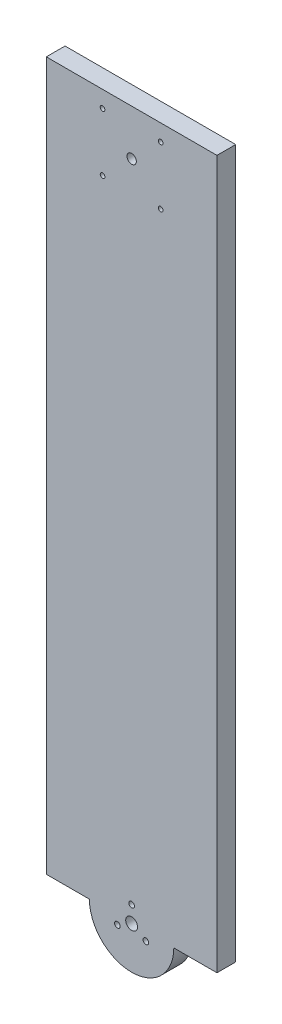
ISO-10303-21;
HEADER;
FILE_DESCRIPTION(('STEP AP214'),'2;1');
FILE_NAME('part.step','',(''),(''),'','','');
FILE_SCHEMA(('AUTOMOTIVE_DESIGN { 1 0 10303 214 1 1 1 1 }'));
ENDSEC;
DATA;
#1=APPLICATION_CONTEXT('core data for automotive mechanical design processes');
#2=APPLICATION_PROTOCOL_DEFINITION('international standard','automotive_design',2000,#1);
#3=PRODUCT_CONTEXT('',#1,'mechanical');
#4=PRODUCT('Part','Part','',(#3));
#5=PRODUCT_RELATED_PRODUCT_CATEGORY('part','',(#4));
#6=PRODUCT_DEFINITION_FORMATION('','',#4);
#7=PRODUCT_DEFINITION_CONTEXT('part definition',#1,'design');
#8=PRODUCT_DEFINITION('design','',#6,#7);
#9=PRODUCT_DEFINITION_SHAPE('','',#8);
#10=(LENGTH_UNIT() NAMED_UNIT(*) SI_UNIT(.MILLI.,.METRE.));
#11=(NAMED_UNIT(*) PLANE_ANGLE_UNIT() SI_UNIT($,.RADIAN.));
#12=(NAMED_UNIT(*) SI_UNIT($,.STERADIAN.) SOLID_ANGLE_UNIT());
#13=UNCERTAINTY_MEASURE_WITH_UNIT(LENGTH_MEASURE(1.E-05),#10,'distance_accuracy_value','');
#14=(GEOMETRIC_REPRESENTATION_CONTEXT(3) GLOBAL_UNCERTAINTY_ASSIGNED_CONTEXT((#13)) GLOBAL_UNIT_ASSIGNED_CONTEXT((#10,
#11,#12)) REPRESENTATION_CONTEXT('',''));
#15=CARTESIAN_POINT('',(0.,0.,0.));
#16=DIRECTION('',(0.,0.,1.));
#17=DIRECTION('',(1.,0.,0.));
#18=AXIS2_PLACEMENT_3D('',#15,#16,#17);
#19=CARTESIAN_POINT('',(-5.06539254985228E-12,-247.5,10.));
#20=DIRECTION('',(0.,0.,1.));
#21=DIRECTION('',(1.,0.,0.));
#22=AXIS2_PLACEMENT_3D('',#19,#20,#21);
#23=PLANE('',#22);
#24=CARTESIAN_POINT('',(-5.06539254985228E-12,-247.5,10.));
#25=DIRECTION('',(0.,0.,1.));
#26=DIRECTION('',(1.,0.,0.));
#27=AXIS2_PLACEMENT_3D('',#24,#25,#26);
#28=CIRCLE('',#27,3.15000000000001);
#29=CARTESIAN_POINT('',(3.14999999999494,-247.5,10.));
#30=VERTEX_POINT('',#29);
#31=EDGE_CURVE('E136',#30,#30,#28,.T.);
#32=ORIENTED_EDGE('',*,*,#31,.F.);
#33=EDGE_LOOP('',(#32));
#34=FACE_BOUND('',#33,.T.);
#35=CARTESIAN_POINT('',(7.57772228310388,-251.875000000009,10.));
#36=DIRECTION('',(0.,0.,1.));
#37=DIRECTION('',(1.,0.,0.));
#38=AXIS2_PLACEMENT_3D('',#35,#36,#37);
#39=CIRCLE('',#38,1.49999999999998);
#40=CARTESIAN_POINT('',(9.07772228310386,-251.875000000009,10.));
#41=VERTEX_POINT('',#40);
#42=EDGE_CURVE('E148',#41,#41,#39,.T.);
#43=ORIENTED_EDGE('',*,*,#42,.F.);
#44=EDGE_LOOP('',(#43));
#45=FACE_BOUND('',#44,.T.);
#46=CARTESIAN_POINT('',(-15.4999999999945,90.1639203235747,10.));
#47=DIRECTION('',(0.,0.,1.));
#48=DIRECTION('',(-1.,0.,0.));
#49=AXIS2_PLACEMENT_3D('',#46,#47,#48);
#50=CIRCLE('',#49,1.25);
#51=CARTESIAN_POINT('',(-16.7499999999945,90.1639203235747,10.));
#52=VERTEX_POINT('',#51);
#53=EDGE_CURVE('E160',#52,#52,#50,.T.);
#54=ORIENTED_EDGE('',*,*,#53,.F.);
#55=EDGE_LOOP('',(#54));
#56=FACE_BOUND('',#55,.T.);
#57=CARTESIAN_POINT('',(15.5000000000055,121.163920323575,10.));
#58=DIRECTION('',(0.,0.,1.));
#59=DIRECTION('',(-1.,0.,0.));
#60=AXIS2_PLACEMENT_3D('',#57,#58,#59);
#61=CIRCLE('',#60,1.25);
#62=CARTESIAN_POINT('',(14.2500000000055,121.163920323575,10.));
#63=VERTEX_POINT('',#62);
#64=EDGE_CURVE('E172',#63,#63,#61,.T.);
#65=ORIENTED_EDGE('',*,*,#64,.F.);
#66=EDGE_LOOP('',(#65));
#67=FACE_BOUND('',#66,.T.);
#68=DIRECTION('',(-1.,0.,0.));
#69=VECTOR('',#68,1.);
#70=CARTESIAN_POINT('',(-22.5,130.,10.));
#71=LINE('',#70,#69);
#72=CARTESIAN_POINT('',(45.5000000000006,130.,10.));
#73=VERTEX_POINT('',#72);
#74=CARTESIAN_POINT('',(-45.4999999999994,130.,10.));
#75=VERTEX_POINT('',#74);
#76=EDGE_CURVE('E184',#73,#75,#71,.T.);
#77=ORIENTED_EDGE('',*,*,#76,.T.);
#78=DIRECTION('',(0.,1.,0.));
#79=VECTOR('',#78,1.);
#80=CARTESIAN_POINT('',(-45.4999999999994,130.,10.));
#81=LINE('',#80,#79);
#82=CARTESIAN_POINT('',(-45.5000000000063,-247.5,10.));
#83=VERTEX_POINT('',#82);
#84=EDGE_CURVE('E95',#83,#75,#81,.T.);
#85=ORIENTED_EDGE('',*,*,#84,.F.);
#86=DIRECTION('',(1.,0.,0.));
#87=VECTOR('',#86,1.);
#88=CARTESIAN_POINT('',(-45.5000000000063,-247.5,10.));
#89=LINE('',#88,#87);
#90=CARTESIAN_POINT('',(-22.5000000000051,-247.5,10.));
#91=VERTEX_POINT('',#90);
#92=EDGE_CURVE('E91',#83,#91,#89,.T.);
#93=ORIENTED_EDGE('',*,*,#92,.T.);
#94=CARTESIAN_POINT('',(-5.06539254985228E-12,-247.5,10.));
#95=DIRECTION('',(0.,0.,1.));
#96=DIRECTION('',(1.,0.,0.));
#97=AXIS2_PLACEMENT_3D('',#94,#95,#96);
#98=CIRCLE('',#97,22.5);
#99=CARTESIAN_POINT('',(22.4999999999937,-247.5,9.99999999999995));
#100=VERTEX_POINT('',#99);
#101=EDGE_CURVE('E49',#91,#100,#98,.T.);
#102=ORIENTED_EDGE('',*,*,#101,.T.);
#103=DIRECTION('',(-1.,0.,0.));
#104=VECTOR('',#103,1.);
#105=CARTESIAN_POINT('',(45.4999999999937,-247.5,9.99999999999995));
#106=LINE('',#105,#104);
#107=CARTESIAN_POINT('',(45.4999999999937,-247.5,9.99999999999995));
#108=VERTEX_POINT('',#107);
#109=EDGE_CURVE('E127',#108,#100,#106,.T.);
#110=ORIENTED_EDGE('',*,*,#109,.F.);
#111=DIRECTION('',(0.,-1.,0.));
#112=VECTOR('',#111,1.);
#113=CARTESIAN_POINT('',(45.5000000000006,130.,10.));
#114=LINE('',#113,#112);
#115=EDGE_CURVE('E110',#73,#108,#114,.T.);
#116=ORIENTED_EDGE('',*,*,#115,.F.);
#117=EDGE_LOOP('',(#77,#85,#93,#102,#110,#116));
#118=FACE_BOUND('',#117,.T.);
#119=CARTESIAN_POINT('',(-15.4999999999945,121.163920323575,10.));
#120=DIRECTION('',(0.,0.,1.));
#121=DIRECTION('',(1.,0.,0.));
#122=AXIS2_PLACEMENT_3D('',#119,#120,#121);
#123=CIRCLE('',#122,1.25);
#124=CARTESIAN_POINT('',(-14.2499999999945,121.163920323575,10.));
#125=VERTEX_POINT('',#124);
#126=EDGE_CURVE('E178',#125,#125,#123,.T.);
#127=ORIENTED_EDGE('',*,*,#126,.F.);
#128=EDGE_LOOP('',(#127));
#129=FACE_BOUND('',#128,.T.);
#130=CARTESIAN_POINT('',(15.5000000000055,90.1639203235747,10.));
#131=DIRECTION('',(0.,0.,1.));
#132=DIRECTION('',(1.,0.,0.));
#133=AXIS2_PLACEMENT_3D('',#130,#131,#132);
#134=CIRCLE('',#133,1.25);
#135=CARTESIAN_POINT('',(16.7500000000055,90.1639203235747,10.));
#136=VERTEX_POINT('',#135);
#137=EDGE_CURVE('E166',#136,#136,#134,.T.);
#138=ORIENTED_EDGE('',*,*,#137,.F.);
#139=EDGE_LOOP('',(#138));
#140=FACE_BOUND('',#139,.T.);
#141=CARTESIAN_POINT('',(5.4678483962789E-12,105.663920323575,10.));
#142=DIRECTION('',(0.,0.,1.));
#143=DIRECTION('',(1.,0.,0.));
#144=AXIS2_PLACEMENT_3D('',#141,#142,#143);
#145=CIRCLE('',#144,2.5);
#146=CARTESIAN_POINT('',(2.50000000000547,105.663920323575,10.));
#147=VERTEX_POINT('',#146);
#148=EDGE_CURVE('E154',#147,#147,#145,.T.);
#149=ORIENTED_EDGE('',*,*,#148,.F.);
#150=EDGE_LOOP('',(#149));
#151=FACE_BOUND('',#150,.T.);
#152=CARTESIAN_POINT('',(5.46489483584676E-12,-238.75,10.));
#153=DIRECTION('',(0.,0.,1.));
#154=DIRECTION('',(1.,0.,0.));
#155=AXIS2_PLACEMENT_3D('',#152,#153,#154);
#156=CIRCLE('',#155,1.5);
#157=CARTESIAN_POINT('',(1.50000000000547,-238.75,10.));
#158=VERTEX_POINT('',#157);
#159=EDGE_CURVE('E142',#158,#158,#156,.T.);
#160=ORIENTED_EDGE('',*,*,#159,.F.);
#161=EDGE_LOOP('',(#160));
#162=FACE_BOUND('',#161,.T.);
#163=CARTESIAN_POINT('',(-7.57772228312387,-251.874999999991,10.));
#164=DIRECTION('',(0.,0.,1.));
#165=DIRECTION('',(1.,0.,0.));
#166=AXIS2_PLACEMENT_3D('',#163,#164,#165);
#167=CIRCLE('',#166,1.49999999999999);
#168=CARTESIAN_POINT('',(-6.07772228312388,-251.874999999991,10.));
#169=VERTEX_POINT('',#168);
#170=EDGE_CURVE('E130',#169,#169,#167,.T.);
#171=ORIENTED_EDGE('',*,*,#170,.F.);
#172=EDGE_LOOP('',(#171));
#173=FACE_BOUND('',#172,.T.);
#174=ADVANCED_FACE('F35',(#34,#45,#56,#67,#118,#129,#140,#151,#162,#173),#23,.T.);
#175=CARTESIAN_POINT('',(-5.06539254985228E-12,-247.5,0.));
#176=DIRECTION('',(0.,0.,1.));
#177=DIRECTION('',(1.,0.,0.));
#178=AXIS2_PLACEMENT_3D('',#175,#176,#177);
#179=PLANE('',#178);
#180=CARTESIAN_POINT('',(-5.06539254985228E-12,-247.5,0.));
#181=DIRECTION('',(0.,0.,1.));
#182=DIRECTION('',(1.,0.,0.));
#183=AXIS2_PLACEMENT_3D('',#180,#181,#182);
#184=CIRCLE('',#183,22.5);
#185=CARTESIAN_POINT('',(-22.5000000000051,-247.5,0.));
#186=VERTEX_POINT('',#185);
#187=CARTESIAN_POINT('',(22.4999999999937,-247.5,0.));
#188=VERTEX_POINT('',#187);
#189=EDGE_CURVE('E109',#186,#188,#184,.T.);
#190=ORIENTED_EDGE('',*,*,#189,.F.);
#191=DIRECTION('',(1.,0.,0.));
#192=VECTOR('',#191,1.);
#193=CARTESIAN_POINT('',(-45.5000000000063,-247.5,0.));
#194=LINE('',#193,#192);
#195=CARTESIAN_POINT('',(-45.5000000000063,-247.5,0.));
#196=VERTEX_POINT('',#195);
#197=EDGE_CURVE('E89',#196,#186,#194,.T.);
#198=ORIENTED_EDGE('',*,*,#197,.F.);
#199=DIRECTION('',(0.,-1.,0.));
#200=VECTOR('',#199,1.);
#201=CARTESIAN_POINT('',(-45.4999999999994,130.,0.));
#202=LINE('',#201,#200);
#203=CARTESIAN_POINT('',(-45.4999999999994,130.,0.));
#204=VERTEX_POINT('',#203);
#205=EDGE_CURVE('E96',#204,#196,#202,.T.);
#206=ORIENTED_EDGE('',*,*,#205,.F.);
#207=DIRECTION('',(-1.,0.,0.));
#208=VECTOR('',#207,1.);
#209=CARTESIAN_POINT('',(-22.5,130.,0.));
#210=LINE('',#209,#208);
#211=CARTESIAN_POINT('',(45.5000000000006,130.,0.));
#212=VERTEX_POINT('',#211);
#213=EDGE_CURVE('E185',#212,#204,#210,.T.);
#214=ORIENTED_EDGE('',*,*,#213,.F.);
#215=DIRECTION('',(0.,1.,0.));
#216=VECTOR('',#215,1.);
#217=CARTESIAN_POINT('',(45.5000000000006,130.,0.));
#218=LINE('',#217,#216);
#219=CARTESIAN_POINT('',(45.4999999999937,-247.5,0.));
#220=VERTEX_POINT('',#219);
#221=EDGE_CURVE('E119',#220,#212,#218,.T.);
#222=ORIENTED_EDGE('',*,*,#221,.F.);
#223=DIRECTION('',(-1.,0.,0.));
#224=VECTOR('',#223,1.);
#225=CARTESIAN_POINT('',(45.4999999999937,-247.5,0.));
#226=LINE('',#225,#224);
#227=EDGE_CURVE('E125',#220,#188,#226,.T.);
#228=ORIENTED_EDGE('',*,*,#227,.T.);
#229=EDGE_LOOP('',(#190,#198,#206,#214,#222,#228));
#230=FACE_BOUND('',#229,.T.);
#231=CARTESIAN_POINT('',(-15.4999999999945,121.163920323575,0.));
#232=DIRECTION('',(0.,0.,1.));
#233=DIRECTION('',(1.,0.,0.));
#234=AXIS2_PLACEMENT_3D('',#231,#232,#233);
#235=CIRCLE('',#234,1.25);
#236=CARTESIAN_POINT('',(-14.2499999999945,121.163920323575,0.));
#237=VERTEX_POINT('',#236);
#238=EDGE_CURVE('E175',#237,#237,#235,.T.);
#239=ORIENTED_EDGE('',*,*,#238,.T.);
#240=EDGE_LOOP('',(#239));
#241=FACE_BOUND('',#240,.T.);
#242=CARTESIAN_POINT('',(15.5000000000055,121.163920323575,0.));
#243=DIRECTION('',(0.,0.,1.));
#244=DIRECTION('',(-1.,0.,0.));
#245=AXIS2_PLACEMENT_3D('',#242,#243,#244);
#246=CIRCLE('',#245,1.25);
#247=CARTESIAN_POINT('',(14.2500000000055,121.163920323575,0.));
#248=VERTEX_POINT('',#247);
#249=EDGE_CURVE('E169',#248,#248,#246,.T.);
#250=ORIENTED_EDGE('',*,*,#249,.T.);
#251=EDGE_LOOP('',(#250));
#252=FACE_BOUND('',#251,.T.);
#253=CARTESIAN_POINT('',(15.5000000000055,90.1639203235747,0.));
#254=DIRECTION('',(0.,0.,1.));
#255=DIRECTION('',(1.,0.,0.));
#256=AXIS2_PLACEMENT_3D('',#253,#254,#255);
#257=CIRCLE('',#256,1.25);
#258=CARTESIAN_POINT('',(16.7500000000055,90.1639203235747,0.));
#259=VERTEX_POINT('',#258);
#260=EDGE_CURVE('E163',#259,#259,#257,.T.);
#261=ORIENTED_EDGE('',*,*,#260,.T.);
#262=EDGE_LOOP('',(#261));
#263=FACE_BOUND('',#262,.T.);
#264=CARTESIAN_POINT('',(-15.4999999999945,90.1639203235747,0.));
#265=DIRECTION('',(0.,0.,1.));
#266=DIRECTION('',(-1.,0.,0.));
#267=AXIS2_PLACEMENT_3D('',#264,#265,#266);
#268=CIRCLE('',#267,1.25);
#269=CARTESIAN_POINT('',(-16.7499999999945,90.1639203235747,0.));
#270=VERTEX_POINT('',#269);
#271=EDGE_CURVE('E157',#270,#270,#268,.T.);
#272=ORIENTED_EDGE('',*,*,#271,.T.);
#273=EDGE_LOOP('',(#272));
#274=FACE_BOUND('',#273,.T.);
#275=CARTESIAN_POINT('',(5.4678483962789E-12,105.663920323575,0.));
#276=DIRECTION('',(0.,0.,1.));
#277=DIRECTION('',(1.,0.,0.));
#278=AXIS2_PLACEMENT_3D('',#275,#276,#277);
#279=CIRCLE('',#278,2.5);
#280=CARTESIAN_POINT('',(2.50000000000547,105.663920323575,0.));
#281=VERTEX_POINT('',#280);
#282=EDGE_CURVE('E151',#281,#281,#279,.T.);
#283=ORIENTED_EDGE('',*,*,#282,.T.);
#284=EDGE_LOOP('',(#283));
#285=FACE_BOUND('',#284,.T.);
#286=CARTESIAN_POINT('',(7.57772228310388,-251.875000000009,0.));
#287=DIRECTION('',(0.,0.,1.));
#288=DIRECTION('',(1.,0.,0.));
#289=AXIS2_PLACEMENT_3D('',#286,#287,#288);
#290=CIRCLE('',#289,1.49999999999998);
#291=CARTESIAN_POINT('',(9.07772228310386,-251.875000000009,0.));
#292=VERTEX_POINT('',#291);
#293=EDGE_CURVE('E145',#292,#292,#290,.T.);
#294=ORIENTED_EDGE('',*,*,#293,.T.);
#295=EDGE_LOOP('',(#294));
#296=FACE_BOUND('',#295,.T.);
#297=CARTESIAN_POINT('',(5.46489483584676E-12,-238.75,0.));
#298=DIRECTION('',(0.,0.,1.));
#299=DIRECTION('',(1.,0.,0.));
#300=AXIS2_PLACEMENT_3D('',#297,#298,#299);
#301=CIRCLE('',#300,1.5);
#302=CARTESIAN_POINT('',(1.50000000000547,-238.75,0.));
#303=VERTEX_POINT('',#302);
#304=EDGE_CURVE('E139',#303,#303,#301,.T.);
#305=ORIENTED_EDGE('',*,*,#304,.T.);
#306=EDGE_LOOP('',(#305));
#307=FACE_BOUND('',#306,.T.);
#308=CARTESIAN_POINT('',(-5.06539254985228E-12,-247.5,0.));
#309=DIRECTION('',(0.,0.,1.));
#310=DIRECTION('',(1.,0.,0.));
#311=AXIS2_PLACEMENT_3D('',#308,#309,#310);
#312=CIRCLE('',#311,3.15000000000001);
#313=CARTESIAN_POINT('',(3.14999999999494,-247.5,0.));
#314=VERTEX_POINT('',#313);
#315=EDGE_CURVE('E133',#314,#314,#312,.T.);
#316=ORIENTED_EDGE('',*,*,#315,.T.);
#317=EDGE_LOOP('',(#316));
#318=FACE_BOUND('',#317,.T.);
#319=CARTESIAN_POINT('',(-7.57772228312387,-251.874999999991,0.));
#320=DIRECTION('',(0.,0.,1.));
#321=DIRECTION('',(1.,0.,0.));
#322=AXIS2_PLACEMENT_3D('',#319,#320,#321);
#323=CIRCLE('',#322,1.49999999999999);
#324=CARTESIAN_POINT('',(-6.07772228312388,-251.874999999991,0.));
#325=VERTEX_POINT('',#324);
#326=EDGE_CURVE('E129',#325,#325,#323,.T.);
#327=ORIENTED_EDGE('',*,*,#326,.T.);
#328=EDGE_LOOP('',(#327));
#329=FACE_BOUND('',#328,.T.);
#330=ADVANCED_FACE('F105',(#230,#241,#252,#263,#274,#285,#296,#307,#318,#329),#179,.F.);
#331=CARTESIAN_POINT('',(-5.06539254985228E-12,-247.5,10.));
#332=DIRECTION('',(0.,0.,-1.));
#333=DIRECTION('',(-1.,0.,0.));
#334=AXIS2_PLACEMENT_3D('',#331,#332,#333);
#335=CYLINDRICAL_SURFACE('',#334,22.5);
#336=ORIENTED_EDGE('',*,*,#189,.T.);
#337=DIRECTION('',(0.,0.,-1.));
#338=VECTOR('',#337,1.);
#339=CARTESIAN_POINT('',(22.4999999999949,-247.5,10.));
#340=LINE('',#339,#338);
#341=EDGE_CURVE('E44',#100,#188,#340,.T.);
#342=ORIENTED_EDGE('',*,*,#341,.F.);
#343=ORIENTED_EDGE('',*,*,#101,.F.);
#344=DIRECTION('',(0.,0.,-1.));
#345=VECTOR('',#344,1.);
#346=CARTESIAN_POINT('',(-22.5000000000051,-247.5,10.));
#347=LINE('',#346,#345);
#348=EDGE_CURVE('E11',#91,#186,#347,.T.);
#349=ORIENTED_EDGE('',*,*,#348,.T.);
#350=EDGE_LOOP('',(#336,#342,#343,#349));
#351=FACE_BOUND('',#350,.T.);
#352=ADVANCED_FACE('F37',(#351),#335,.T.);
#353=CARTESIAN_POINT('',(-22.5,130.,10.));
#354=DIRECTION('',(0.,-1.,0.));
#355=DIRECTION('',(0.,0.,-1.));
#356=AXIS2_PLACEMENT_3D('',#353,#354,#355);
#357=PLANE('',#356);
#358=ORIENTED_EDGE('',*,*,#213,.T.);
#359=DIRECTION('',(0.,0.,-1.));
#360=VECTOR('',#359,1.);
#361=CARTESIAN_POINT('',(-45.4999999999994,130.,0.));
#362=LINE('',#361,#360);
#363=EDGE_CURVE('E102',#75,#204,#362,.T.);
#364=ORIENTED_EDGE('',*,*,#363,.F.);
#365=ORIENTED_EDGE('',*,*,#76,.F.);
#366=DIRECTION('',(0.,0.,1.));
#367=VECTOR('',#366,1.);
#368=CARTESIAN_POINT('',(45.5000000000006,130.,10.));
#369=LINE('',#368,#367);
#370=EDGE_CURVE('E122',#212,#73,#369,.T.);
#371=ORIENTED_EDGE('',*,*,#370,.F.);
#372=EDGE_LOOP('',(#358,#364,#365,#371));
#373=FACE_BOUND('',#372,.T.);
#374=ADVANCED_FACE('F198',(#373),#357,.F.);
#375=CARTESIAN_POINT('',(-15.4999999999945,121.163920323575,10.));
#376=DIRECTION('',(0.,0.,-1.));
#377=DIRECTION('',(-1.,0.,0.));
#378=AXIS2_PLACEMENT_3D('',#375,#376,#377);
#379=CYLINDRICAL_SURFACE('',#378,1.25);
#380=ORIENTED_EDGE('',*,*,#126,.T.);
#381=EDGE_LOOP('',(#380));
#382=FACE_BOUND('',#381,.T.);
#383=ORIENTED_EDGE('',*,*,#238,.F.);
#384=EDGE_LOOP('',(#383));
#385=FACE_BOUND('',#384,.T.);
#386=ADVANCED_FACE('F221',(#382,#385),#379,.F.);
#387=CARTESIAN_POINT('',(15.5000000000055,121.163920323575,10.));
#388=DIRECTION('',(0.,0.,-1.));
#389=DIRECTION('',(-1.,0.,0.));
#390=AXIS2_PLACEMENT_3D('',#387,#388,#389);
#391=CYLINDRICAL_SURFACE('',#390,1.25);
#392=ORIENTED_EDGE('',*,*,#64,.T.);
#393=EDGE_LOOP('',(#392));
#394=FACE_BOUND('',#393,.T.);
#395=ORIENTED_EDGE('',*,*,#249,.F.);
#396=EDGE_LOOP('',(#395));
#397=FACE_BOUND('',#396,.T.);
#398=ADVANCED_FACE('F228',(#394,#397),#391,.F.);
#399=CARTESIAN_POINT('',(15.5000000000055,90.1639203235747,10.));
#400=DIRECTION('',(0.,0.,-1.));
#401=DIRECTION('',(-1.,0.,0.));
#402=AXIS2_PLACEMENT_3D('',#399,#400,#401);
#403=CYLINDRICAL_SURFACE('',#402,1.25);
#404=ORIENTED_EDGE('',*,*,#137,.T.);
#405=EDGE_LOOP('',(#404));
#406=FACE_BOUND('',#405,.T.);
#407=ORIENTED_EDGE('',*,*,#260,.F.);
#408=EDGE_LOOP('',(#407));
#409=FACE_BOUND('',#408,.T.);
#410=ADVANCED_FACE('F313',(#406,#409),#403,.F.);
#411=CARTESIAN_POINT('',(-15.4999999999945,90.1639203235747,10.));
#412=DIRECTION('',(0.,0.,-1.));
#413=DIRECTION('',(-1.,0.,0.));
#414=AXIS2_PLACEMENT_3D('',#411,#412,#413);
#415=CYLINDRICAL_SURFACE('',#414,1.25);
#416=ORIENTED_EDGE('',*,*,#53,.T.);
#417=EDGE_LOOP('',(#416));
#418=FACE_BOUND('',#417,.T.);
#419=ORIENTED_EDGE('',*,*,#271,.F.);
#420=EDGE_LOOP('',(#419));
#421=FACE_BOUND('',#420,.T.);
#422=ADVANCED_FACE('F303',(#418,#421),#415,.F.);
#423=CARTESIAN_POINT('',(5.4678483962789E-12,105.663920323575,10.));
#424=DIRECTION('',(0.,0.,-1.));
#425=DIRECTION('',(-1.,0.,0.));
#426=AXIS2_PLACEMENT_3D('',#423,#424,#425);
#427=CYLINDRICAL_SURFACE('',#426,2.5);
#428=ORIENTED_EDGE('',*,*,#148,.T.);
#429=EDGE_LOOP('',(#428));
#430=FACE_BOUND('',#429,.T.);
#431=ORIENTED_EDGE('',*,*,#282,.F.);
#432=EDGE_LOOP('',(#431));
#433=FACE_BOUND('',#432,.T.);
#434=ADVANCED_FACE('F293',(#430,#433),#427,.F.);
#435=CARTESIAN_POINT('',(7.57772228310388,-251.875000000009,10.));
#436=DIRECTION('',(0.,0.,-1.));
#437=DIRECTION('',(-1.,0.,0.));
#438=AXIS2_PLACEMENT_3D('',#435,#436,#437);
#439=CYLINDRICAL_SURFACE('',#438,1.49999999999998);
#440=ORIENTED_EDGE('',*,*,#42,.T.);
#441=EDGE_LOOP('',(#440));
#442=FACE_BOUND('',#441,.T.);
#443=ORIENTED_EDGE('',*,*,#293,.F.);
#444=EDGE_LOOP('',(#443));
#445=FACE_BOUND('',#444,.T.);
#446=ADVANCED_FACE('F283',(#442,#445),#439,.F.);
#447=CARTESIAN_POINT('',(5.46489483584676E-12,-238.75,10.));
#448=DIRECTION('',(0.,0.,-1.));
#449=DIRECTION('',(-1.,0.,0.));
#450=AXIS2_PLACEMENT_3D('',#447,#448,#449);
#451=CYLINDRICAL_SURFACE('',#450,1.5);
#452=ORIENTED_EDGE('',*,*,#159,.T.);
#453=EDGE_LOOP('',(#452));
#454=FACE_BOUND('',#453,.T.);
#455=ORIENTED_EDGE('',*,*,#304,.F.);
#456=EDGE_LOOP('',(#455));
#457=FACE_BOUND('',#456,.T.);
#458=ADVANCED_FACE('F273',(#454,#457),#451,.F.);
#459=CARTESIAN_POINT('',(-5.06539254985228E-12,-247.5,10.));
#460=DIRECTION('',(0.,0.,-1.));
#461=DIRECTION('',(-1.,0.,0.));
#462=AXIS2_PLACEMENT_3D('',#459,#460,#461);
#463=CYLINDRICAL_SURFACE('',#462,3.15000000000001);
#464=ORIENTED_EDGE('',*,*,#31,.T.);
#465=EDGE_LOOP('',(#464));
#466=FACE_BOUND('',#465,.T.);
#467=ORIENTED_EDGE('',*,*,#315,.F.);
#468=EDGE_LOOP('',(#467));
#469=FACE_BOUND('',#468,.T.);
#470=ADVANCED_FACE('F263',(#466,#469),#463,.F.);
#471=CARTESIAN_POINT('',(-7.57772228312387,-251.874999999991,10.));
#472=DIRECTION('',(0.,0.,-1.));
#473=DIRECTION('',(-1.,0.,0.));
#474=AXIS2_PLACEMENT_3D('',#471,#472,#473);
#475=CYLINDRICAL_SURFACE('',#474,1.49999999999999);
#476=ORIENTED_EDGE('',*,*,#170,.T.);
#477=EDGE_LOOP('',(#476));
#478=FACE_BOUND('',#477,.T.);
#479=ORIENTED_EDGE('',*,*,#326,.F.);
#480=EDGE_LOOP('',(#479));
#481=FACE_BOUND('',#480,.T.);
#482=ADVANCED_FACE('F209',(#478,#481),#475,.F.);
#483=CARTESIAN_POINT('',(45.4999999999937,-247.5,9.99999999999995));
#484=DIRECTION('',(0.,1.,0.));
#485=DIRECTION('',(-1.,0.,0.));
#486=AXIS2_PLACEMENT_3D('',#483,#484,#485);
#487=PLANE('',#486);
#488=ORIENTED_EDGE('',*,*,#341,.T.);
#489=ORIENTED_EDGE('',*,*,#227,.F.);
#490=DIRECTION('',(0.,0.,-1.));
#491=VECTOR('',#490,1.);
#492=CARTESIAN_POINT('',(45.4999999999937,-247.5,9.99999999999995));
#493=LINE('',#492,#491);
#494=EDGE_CURVE('E113',#108,#220,#493,.T.);
#495=ORIENTED_EDGE('',*,*,#494,.F.);
#496=ORIENTED_EDGE('',*,*,#109,.T.);
#497=EDGE_LOOP('',(#488,#489,#495,#496));
#498=FACE_BOUND('',#497,.T.);
#499=ADVANCED_FACE('F190',(#498),#487,.F.);
#500=CARTESIAN_POINT('',(45.4999999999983,-8.31711240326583E-13,0.));
#501=DIRECTION('',(1.,0.,0.));
#502=DIRECTION('',(0.,1.,0.));
#503=AXIS2_PLACEMENT_3D('',#500,#501,#502);
#504=PLANE('',#503);
#505=ORIENTED_EDGE('',*,*,#115,.T.);
#506=ORIENTED_EDGE('',*,*,#494,.T.);
#507=ORIENTED_EDGE('',*,*,#221,.T.);
#508=ORIENTED_EDGE('',*,*,#370,.T.);
#509=EDGE_LOOP('',(#505,#506,#507,#508));
#510=FACE_BOUND('',#509,.T.);
#511=ADVANCED_FACE('F201',(#510),#504,.T.);
#512=CARTESIAN_POINT('',(-45.5000000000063,-247.5,0.));
#513=DIRECTION('',(0.,1.,0.));
#514=DIRECTION('',(-1.,0.,0.));
#515=AXIS2_PLACEMENT_3D('',#512,#513,#514);
#516=PLANE('',#515);
#517=ORIENTED_EDGE('',*,*,#348,.F.);
#518=ORIENTED_EDGE('',*,*,#92,.F.);
#519=DIRECTION('',(0.,0.,1.));
#520=VECTOR('',#519,1.);
#521=CARTESIAN_POINT('',(-45.5000000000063,-247.5,0.));
#522=LINE('',#521,#520);
#523=EDGE_CURVE('E85',#196,#83,#522,.T.);
#524=ORIENTED_EDGE('',*,*,#523,.F.);
#525=ORIENTED_EDGE('',*,*,#197,.T.);
#526=EDGE_LOOP('',(#517,#518,#524,#525));
#527=FACE_BOUND('',#526,.T.);
#528=ADVANCED_FACE('F87',(#527),#516,.F.);
#529=CARTESIAN_POINT('',(-45.5000000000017,8.31711240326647E-13,0.));
#530=DIRECTION('',(-1.,0.,0.));
#531=DIRECTION('',(0.,-1.,0.));
#532=AXIS2_PLACEMENT_3D('',#529,#530,#531);
#533=PLANE('',#532);
#534=ORIENTED_EDGE('',*,*,#205,.T.);
#535=ORIENTED_EDGE('',*,*,#523,.T.);
#536=ORIENTED_EDGE('',*,*,#84,.T.);
#537=ORIENTED_EDGE('',*,*,#363,.T.);
#538=EDGE_LOOP('',(#534,#535,#536,#537));
#539=FACE_BOUND('',#538,.T.);
#540=ADVANCED_FACE('F100',(#539),#533,.T.);
#541=CLOSED_SHELL('',(#174,#330,#352,#374,#386,#398,#410,#422,#434,#446,#458,#470,#482,#499,
#511,#528,#540));
#542=MANIFOLD_SOLID_BREP('B2',#541);
#543=ADVANCED_BREP_SHAPE_REPRESENTATION('',(#18,#542),#14);
#544=SHAPE_DEFINITION_REPRESENTATION(#9,#543);
ENDSEC;
END-ISO-10303-21;
